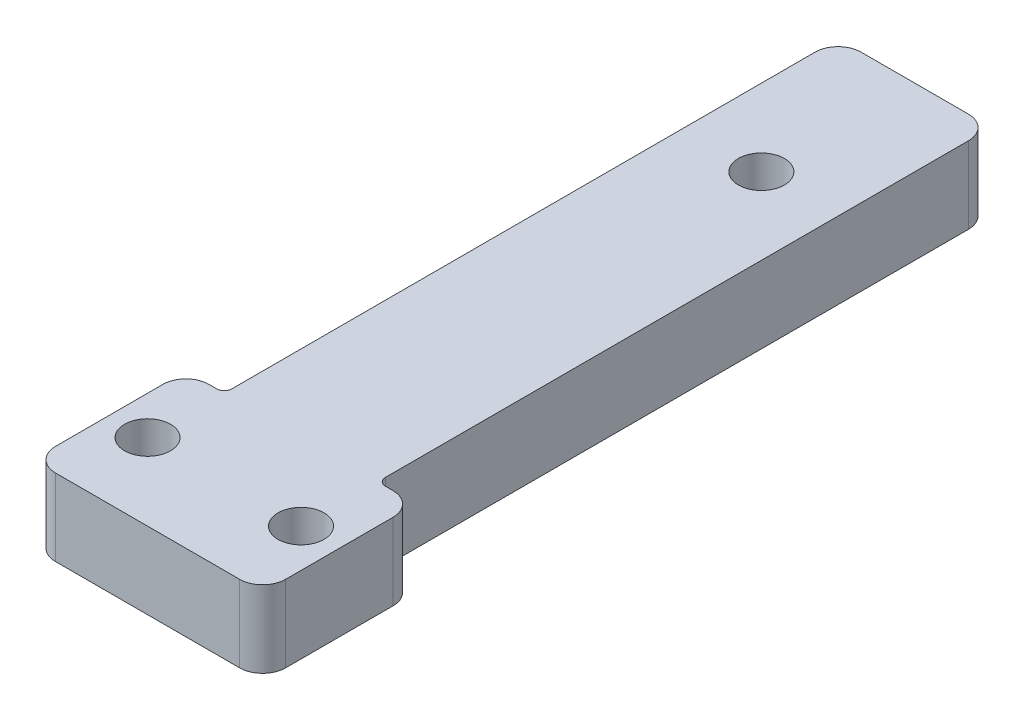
ISO-10303-21;
HEADER;
FILE_DESCRIPTION(('STEP AP214'),'2;1');
FILE_NAME('part.step','',(''),(''),'','','');
FILE_SCHEMA(('AUTOMOTIVE_DESIGN { 1 0 10303 214 1 1 1 1 }'));
ENDSEC;
DATA;
#1=APPLICATION_CONTEXT('core data for automotive mechanical design processes');
#2=APPLICATION_PROTOCOL_DEFINITION('international standard','automotive_design',2000,#1);
#3=PRODUCT_CONTEXT('',#1,'mechanical');
#4=PRODUCT('Part','Part','',(#3));
#5=PRODUCT_RELATED_PRODUCT_CATEGORY('part','',(#4));
#6=PRODUCT_DEFINITION_FORMATION('','',#4);
#7=PRODUCT_DEFINITION_CONTEXT('part definition',#1,'design');
#8=PRODUCT_DEFINITION('design','',#6,#7);
#9=PRODUCT_DEFINITION_SHAPE('','',#8);
#10=(LENGTH_UNIT() NAMED_UNIT(*) SI_UNIT(.MILLI.,.METRE.));
#11=(NAMED_UNIT(*) PLANE_ANGLE_UNIT() SI_UNIT($,.RADIAN.));
#12=(NAMED_UNIT(*) SI_UNIT($,.STERADIAN.) SOLID_ANGLE_UNIT());
#13=UNCERTAINTY_MEASURE_WITH_UNIT(LENGTH_MEASURE(1.E-05),#10,'distance_accuracy_value','');
#14=(GEOMETRIC_REPRESENTATION_CONTEXT(3) GLOBAL_UNCERTAINTY_ASSIGNED_CONTEXT((#13)) GLOBAL_UNIT_ASSIGNED_CONTEXT((#10,
#11,#12)) REPRESENTATION_CONTEXT('',''));
#15=CARTESIAN_POINT('',(0.,0.,0.));
#16=DIRECTION('',(0.,0.,1.));
#17=DIRECTION('',(1.,0.,0.));
#18=AXIS2_PLACEMENT_3D('',#15,#16,#17);
#19=CARTESIAN_POINT('',(22.,10.,-97.));
#20=DIRECTION('',(0.,-1.,0.));
#21=DIRECTION('',(0.,0.,-1.));
#22=AXIS2_PLACEMENT_3D('',#19,#20,#21);
#23=CYLINDRICAL_SURFACE('',#22,3.);
#24=CARTESIAN_POINT('',(22.,0.,-97.));
#25=DIRECTION('',(0.,1.,0.));
#26=DIRECTION('',(0.,0.,1.));
#27=AXIS2_PLACEMENT_3D('',#24,#25,#26);
#28=CIRCLE('',#27,3.);
#29=CARTESIAN_POINT('',(25.,0.,-97.));
#30=VERTEX_POINT('',#29);
#31=CARTESIAN_POINT('',(22.,0.,-100.));
#32=VERTEX_POINT('',#31);
#33=EDGE_CURVE('E177',#30,#32,#28,.T.);
#34=ORIENTED_EDGE('',*,*,#33,.T.);
#35=DIRECTION('',(0.,-1.,0.));
#36=VECTOR('',#35,1.);
#37=CARTESIAN_POINT('',(22.,10.,-100.));
#38=LINE('',#37,#36);
#39=CARTESIAN_POINT('',(22.,10.,-100.));
#40=VERTEX_POINT('',#39);
#41=EDGE_CURVE('E11',#40,#32,#38,.T.);
#42=ORIENTED_EDGE('',*,*,#41,.F.);
#43=CARTESIAN_POINT('',(22.,10.,-97.));
#44=DIRECTION('',(0.,1.,0.));
#45=DIRECTION('',(0.,0.,1.));
#46=AXIS2_PLACEMENT_3D('',#43,#44,#45);
#47=CIRCLE('',#46,3.);
#48=CARTESIAN_POINT('',(25.,10.,-97.));
#49=VERTEX_POINT('',#48);
#50=EDGE_CURVE('E208',#49,#40,#47,.T.);
#51=ORIENTED_EDGE('',*,*,#50,.F.);
#52=DIRECTION('',(0.,-1.,0.));
#53=VECTOR('',#52,1.);
#54=CARTESIAN_POINT('',(25.,10.,-97.));
#55=LINE('',#54,#53);
#56=EDGE_CURVE('E173',#49,#30,#55,.T.);
#57=ORIENTED_EDGE('',*,*,#56,.T.);
#58=EDGE_LOOP('',(#34,#42,#51,#57));
#59=FACE_BOUND('',#58,.T.);
#60=ADVANCED_FACE('F33',(#59),#23,.T.);
#61=CARTESIAN_POINT('',(8.00000000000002,10.,-100.));
#62=DIRECTION('',(0.,0.,1.));
#63=DIRECTION('',(1.,0.,0.));
#64=AXIS2_PLACEMENT_3D('',#61,#62,#63);
#65=PLANE('',#64);
#66=DIRECTION('',(-1.,0.,0.));
#67=VECTOR('',#66,1.);
#68=CARTESIAN_POINT('',(8.00000000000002,0.,-100.));
#69=LINE('',#68,#67);
#70=CARTESIAN_POINT('',(8.,0.,-100.));
#71=VERTEX_POINT('',#70);
#72=EDGE_CURVE('E180',#32,#71,#69,.T.);
#73=ORIENTED_EDGE('',*,*,#72,.T.);
#74=DIRECTION('',(0.,-1.,0.));
#75=VECTOR('',#74,1.);
#76=CARTESIAN_POINT('',(8.,10.,-100.));
#77=LINE('',#76,#75);
#78=CARTESIAN_POINT('',(8.,10.,-100.));
#79=VERTEX_POINT('',#78);
#80=EDGE_CURVE('E41',#79,#71,#77,.T.);
#81=ORIENTED_EDGE('',*,*,#80,.F.);
#82=DIRECTION('',(-1.,0.,0.));
#83=VECTOR('',#82,1.);
#84=CARTESIAN_POINT('',(8.00000000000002,10.,-100.));
#85=LINE('',#84,#83);
#86=EDGE_CURVE('E116',#40,#79,#85,.T.);
#87=ORIENTED_EDGE('',*,*,#86,.F.);
#88=ORIENTED_EDGE('',*,*,#41,.T.);
#89=EDGE_LOOP('',(#73,#81,#87,#88));
#90=FACE_BOUND('',#89,.T.);
#91=ADVANCED_FACE('F308',(#90),#65,.F.);
#92=CARTESIAN_POINT('',(8.,10.,-97.));
#93=DIRECTION('',(0.,-1.,0.));
#94=DIRECTION('',(0.,0.,-1.));
#95=AXIS2_PLACEMENT_3D('',#92,#93,#94);
#96=CYLINDRICAL_SURFACE('',#95,3.);
#97=CARTESIAN_POINT('',(8.,0.,-97.));
#98=DIRECTION('',(0.,1.,0.));
#99=DIRECTION('',(0.,0.,-1.));
#100=AXIS2_PLACEMENT_3D('',#97,#98,#99);
#101=CIRCLE('',#100,3.);
#102=CARTESIAN_POINT('',(5.,0.,-97.));
#103=VERTEX_POINT('',#102);
#104=EDGE_CURVE('E183',#71,#103,#101,.T.);
#105=ORIENTED_EDGE('',*,*,#104,.T.);
#106=DIRECTION('',(0.,-1.,0.));
#107=VECTOR('',#106,1.);
#108=CARTESIAN_POINT('',(5.,10.,-97.));
#109=LINE('',#108,#107);
#110=CARTESIAN_POINT('',(5.,10.,-97.));
#111=VERTEX_POINT('',#110);
#112=EDGE_CURVE('E239',#111,#103,#109,.T.);
#113=ORIENTED_EDGE('',*,*,#112,.F.);
#114=CARTESIAN_POINT('',(8.,10.,-97.));
#115=DIRECTION('',(0.,1.,0.));
#116=DIRECTION('',(0.,0.,-1.));
#117=AXIS2_PLACEMENT_3D('',#114,#115,#116);
#118=CIRCLE('',#117,3.);
#119=EDGE_CURVE('E247',#79,#111,#118,.T.);
#120=ORIENTED_EDGE('',*,*,#119,.F.);
#121=ORIENTED_EDGE('',*,*,#80,.T.);
#122=EDGE_LOOP('',(#105,#113,#120,#121));
#123=FACE_BOUND('',#122,.T.);
#124=ADVANCED_FACE('F245',(#123),#96,.T.);
#125=CARTESIAN_POINT('',(5.,10.,-21.));
#126=DIRECTION('',(1.,0.,0.));
#127=DIRECTION('',(0.,0.,-1.));
#128=AXIS2_PLACEMENT_3D('',#125,#126,#127);
#129=PLANE('',#128);
#130=DIRECTION('',(0.,0.,1.));
#131=VECTOR('',#130,1.);
#132=CARTESIAN_POINT('',(5.,0.,-21.));
#133=LINE('',#132,#131);
#134=CARTESIAN_POINT('',(5.,0.,-21.));
#135=VERTEX_POINT('',#134);
#136=EDGE_CURVE('E185',#103,#135,#133,.T.);
#137=ORIENTED_EDGE('',*,*,#136,.T.);
#138=DIRECTION('',(0.,-1.,0.));
#139=VECTOR('',#138,1.);
#140=CARTESIAN_POINT('',(5.,10.,-21.));
#141=LINE('',#140,#139);
#142=CARTESIAN_POINT('',(5.,10.,-21.));
#143=VERTEX_POINT('',#142);
#144=EDGE_CURVE('E236',#143,#135,#141,.T.);
#145=ORIENTED_EDGE('',*,*,#144,.F.);
#146=DIRECTION('',(0.,0.,1.));
#147=VECTOR('',#146,1.);
#148=CARTESIAN_POINT('',(5.,10.,-21.));
#149=LINE('',#148,#147);
#150=EDGE_CURVE('E265',#111,#143,#149,.T.);
#151=ORIENTED_EDGE('',*,*,#150,.F.);
#152=ORIENTED_EDGE('',*,*,#112,.T.);
#153=EDGE_LOOP('',(#137,#145,#151,#152));
#154=FACE_BOUND('',#153,.T.);
#155=ADVANCED_FACE('F256',(#154),#129,.F.);
#156=CARTESIAN_POINT('',(4.,10.,-21.));
#157=DIRECTION('',(0.,-1.,0.));
#158=DIRECTION('',(0.,0.,-1.));
#159=AXIS2_PLACEMENT_3D('',#156,#157,#158);
#160=CYLINDRICAL_SURFACE('',#159,1.);
#161=CARTESIAN_POINT('',(4.,0.,-21.));
#162=DIRECTION('',(0.,-1.,0.));
#163=DIRECTION('',(0.,0.,1.));
#164=AXIS2_PLACEMENT_3D('',#161,#162,#163);
#165=CIRCLE('',#164,1.);
#166=CARTESIAN_POINT('',(3.99999999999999,0.,-20.));
#167=VERTEX_POINT('',#166);
#168=EDGE_CURVE('E187',#135,#167,#165,.T.);
#169=ORIENTED_EDGE('',*,*,#168,.T.);
#170=DIRECTION('',(0.,-1.,0.));
#171=VECTOR('',#170,1.);
#172=CARTESIAN_POINT('',(3.99999999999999,10.,-20.));
#173=LINE('',#172,#171);
#174=CARTESIAN_POINT('',(3.99999999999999,10.,-20.));
#175=VERTEX_POINT('',#174);
#176=EDGE_CURVE('E233',#175,#167,#173,.T.);
#177=ORIENTED_EDGE('',*,*,#176,.F.);
#178=CARTESIAN_POINT('',(4.,10.,-21.));
#179=DIRECTION('',(0.,-1.,0.));
#180=DIRECTION('',(0.,0.,1.));
#181=AXIS2_PLACEMENT_3D('',#178,#179,#180);
#182=CIRCLE('',#181,1.);
#183=EDGE_CURVE('E262',#143,#175,#182,.T.);
#184=ORIENTED_EDGE('',*,*,#183,.F.);
#185=ORIENTED_EDGE('',*,*,#144,.T.);
#186=EDGE_LOOP('',(#169,#177,#184,#185));
#187=FACE_BOUND('',#186,.T.);
#188=ADVANCED_FACE('F260',(#187),#160,.F.);
#189=CARTESIAN_POINT('',(3.00000000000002,10.,-20.));
#190=DIRECTION('',(0.,0.,1.));
#191=DIRECTION('',(1.,0.,0.));
#192=AXIS2_PLACEMENT_3D('',#189,#190,#191);
#193=PLANE('',#192);
#194=DIRECTION('',(-1.,0.,0.));
#195=VECTOR('',#194,1.);
#196=CARTESIAN_POINT('',(3.00000000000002,0.,-20.));
#197=LINE('',#196,#195);
#198=CARTESIAN_POINT('',(3.,0.,-20.));
#199=VERTEX_POINT('',#198);
#200=EDGE_CURVE('E189',#167,#199,#197,.T.);
#201=ORIENTED_EDGE('',*,*,#200,.T.);
#202=DIRECTION('',(0.,-1.,0.));
#203=VECTOR('',#202,1.);
#204=CARTESIAN_POINT('',(3.,10.,-20.));
#205=LINE('',#204,#203);
#206=CARTESIAN_POINT('',(3.,10.,-20.));
#207=VERTEX_POINT('',#206);
#208=EDGE_CURVE('E230',#207,#199,#205,.T.);
#209=ORIENTED_EDGE('',*,*,#208,.F.);
#210=DIRECTION('',(-1.,0.,0.));
#211=VECTOR('',#210,1.);
#212=CARTESIAN_POINT('',(3.00000000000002,10.,-20.));
#213=LINE('',#212,#211);
#214=EDGE_CURVE('E264',#175,#207,#213,.T.);
#215=ORIENTED_EDGE('',*,*,#214,.F.);
#216=ORIENTED_EDGE('',*,*,#176,.T.);
#217=EDGE_LOOP('',(#201,#209,#215,#216));
#218=FACE_BOUND('',#217,.T.);
#219=ADVANCED_FACE('F321',(#218),#193,.F.);
#220=CARTESIAN_POINT('',(3.,10.,-17.));
#221=DIRECTION('',(0.,-1.,0.));
#222=DIRECTION('',(0.,0.,-1.));
#223=AXIS2_PLACEMENT_3D('',#220,#221,#222);
#224=CYLINDRICAL_SURFACE('',#223,3.);
#225=CARTESIAN_POINT('',(3.,0.,-17.));
#226=DIRECTION('',(0.,1.,0.));
#227=DIRECTION('',(0.,0.,-1.));
#228=AXIS2_PLACEMENT_3D('',#225,#226,#227);
#229=CIRCLE('',#228,3.);
#230=CARTESIAN_POINT('',(0.,0.,-17.));
#231=VERTEX_POINT('',#230);
#232=EDGE_CURVE('E191',#199,#231,#229,.T.);
#233=ORIENTED_EDGE('',*,*,#232,.T.);
#234=DIRECTION('',(0.,-1.,0.));
#235=VECTOR('',#234,1.);
#236=CARTESIAN_POINT('',(0.,10.,-17.));
#237=LINE('',#236,#235);
#238=CARTESIAN_POINT('',(0.,10.,-17.));
#239=VERTEX_POINT('',#238);
#240=EDGE_CURVE('E227',#239,#231,#237,.T.);
#241=ORIENTED_EDGE('',*,*,#240,.F.);
#242=CARTESIAN_POINT('',(3.,10.,-17.));
#243=DIRECTION('',(0.,1.,0.));
#244=DIRECTION('',(0.,0.,-1.));
#245=AXIS2_PLACEMENT_3D('',#242,#243,#244);
#246=CIRCLE('',#245,3.);
#247=EDGE_CURVE('E267',#207,#239,#246,.T.);
#248=ORIENTED_EDGE('',*,*,#247,.F.);
#249=ORIENTED_EDGE('',*,*,#208,.T.);
#250=EDGE_LOOP('',(#233,#241,#248,#249));
#251=FACE_BOUND('',#250,.T.);
#252=ADVANCED_FACE('F324',(#251),#224,.T.);
#253=CARTESIAN_POINT('',(0.,10.,-3.00000000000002));
#254=DIRECTION('',(1.,0.,0.));
#255=DIRECTION('',(0.,0.,-1.));
#256=AXIS2_PLACEMENT_3D('',#253,#254,#255);
#257=PLANE('',#256);
#258=DIRECTION('',(0.,0.,1.));
#259=VECTOR('',#258,1.);
#260=CARTESIAN_POINT('',(0.,0.,-3.00000000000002));
#261=LINE('',#260,#259);
#262=CARTESIAN_POINT('',(0.,0.,-3.00000000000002));
#263=VERTEX_POINT('',#262);
#264=EDGE_CURVE('E193',#231,#263,#261,.T.);
#265=ORIENTED_EDGE('',*,*,#264,.T.);
#266=DIRECTION('',(0.,-1.,0.));
#267=VECTOR('',#266,1.);
#268=CARTESIAN_POINT('',(0.,10.,-3.00000000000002));
#269=LINE('',#268,#267);
#270=CARTESIAN_POINT('',(0.,10.,-3.00000000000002));
#271=VERTEX_POINT('',#270);
#272=EDGE_CURVE('E224',#271,#263,#269,.T.);
#273=ORIENTED_EDGE('',*,*,#272,.F.);
#274=DIRECTION('',(0.,0.,1.));
#275=VECTOR('',#274,1.);
#276=CARTESIAN_POINT('',(0.,10.,-3.00000000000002));
#277=LINE('',#276,#275);
#278=EDGE_CURVE('E273',#239,#271,#277,.T.);
#279=ORIENTED_EDGE('',*,*,#278,.F.);
#280=ORIENTED_EDGE('',*,*,#240,.T.);
#281=EDGE_LOOP('',(#265,#273,#279,#280));
#282=FACE_BOUND('',#281,.T.);
#283=ADVANCED_FACE('F328',(#282),#257,.F.);
#284=CARTESIAN_POINT('',(3.,10.,-3.));
#285=DIRECTION('',(0.,-1.,0.));
#286=DIRECTION('',(0.,0.,-1.));
#287=AXIS2_PLACEMENT_3D('',#284,#285,#286);
#288=CYLINDRICAL_SURFACE('',#287,3.);
#289=CARTESIAN_POINT('',(3.,0.,-3.));
#290=DIRECTION('',(0.,1.,0.));
#291=DIRECTION('',(0.,0.,-1.));
#292=AXIS2_PLACEMENT_3D('',#289,#290,#291);
#293=CIRCLE('',#292,3.);
#294=CARTESIAN_POINT('',(3.00000000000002,0.,0.));
#295=VERTEX_POINT('',#294);
#296=EDGE_CURVE('E195',#263,#295,#293,.T.);
#297=ORIENTED_EDGE('',*,*,#296,.T.);
#298=DIRECTION('',(0.,-1.,0.));
#299=VECTOR('',#298,1.);
#300=CARTESIAN_POINT('',(3.00000000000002,10.,0.));
#301=LINE('',#300,#299);
#302=CARTESIAN_POINT('',(3.00000000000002,10.,0.));
#303=VERTEX_POINT('',#302);
#304=EDGE_CURVE('E221',#303,#295,#301,.T.);
#305=ORIENTED_EDGE('',*,*,#304,.F.);
#306=CARTESIAN_POINT('',(3.,10.,-3.));
#307=DIRECTION('',(0.,1.,0.));
#308=DIRECTION('',(0.,0.,-1.));
#309=AXIS2_PLACEMENT_3D('',#306,#307,#308);
#310=CIRCLE('',#309,3.);
#311=EDGE_CURVE('E275',#271,#303,#310,.T.);
#312=ORIENTED_EDGE('',*,*,#311,.F.);
#313=ORIENTED_EDGE('',*,*,#272,.T.);
#314=EDGE_LOOP('',(#297,#305,#312,#313));
#315=FACE_BOUND('',#314,.T.);
#316=ADVANCED_FACE('F332',(#315),#288,.T.);
#317=CARTESIAN_POINT('',(27.,10.,0.));
#318=DIRECTION('',(0.,0.,-1.));
#319=DIRECTION('',(-1.,0.,0.));
#320=AXIS2_PLACEMENT_3D('',#317,#318,#319);
#321=PLANE('',#320);
#322=DIRECTION('',(1.,0.,0.));
#323=VECTOR('',#322,1.);
#324=CARTESIAN_POINT('',(27.,0.,0.));
#325=LINE('',#324,#323);
#326=CARTESIAN_POINT('',(27.,0.,0.));
#327=VERTEX_POINT('',#326);
#328=EDGE_CURVE('E197',#295,#327,#325,.T.);
#329=ORIENTED_EDGE('',*,*,#328,.T.);
#330=DIRECTION('',(0.,-1.,0.));
#331=VECTOR('',#330,1.);
#332=CARTESIAN_POINT('',(27.,10.,0.));
#333=LINE('',#332,#331);
#334=CARTESIAN_POINT('',(27.,10.,0.));
#335=VERTEX_POINT('',#334);
#336=EDGE_CURVE('E218',#335,#327,#333,.T.);
#337=ORIENTED_EDGE('',*,*,#336,.F.);
#338=DIRECTION('',(1.,0.,0.));
#339=VECTOR('',#338,1.);
#340=CARTESIAN_POINT('',(27.,10.,0.));
#341=LINE('',#340,#339);
#342=EDGE_CURVE('E277',#303,#335,#341,.T.);
#343=ORIENTED_EDGE('',*,*,#342,.F.);
#344=ORIENTED_EDGE('',*,*,#304,.T.);
#345=EDGE_LOOP('',(#329,#337,#343,#344));
#346=FACE_BOUND('',#345,.T.);
#347=ADVANCED_FACE('F336',(#346),#321,.F.);
#348=CARTESIAN_POINT('',(27.,10.,-3.));
#349=DIRECTION('',(0.,-1.,0.));
#350=DIRECTION('',(0.,0.,-1.));
#351=AXIS2_PLACEMENT_3D('',#348,#349,#350);
#352=CYLINDRICAL_SURFACE('',#351,3.);
#353=CARTESIAN_POINT('',(27.,0.,-3.));
#354=DIRECTION('',(0.,1.,0.));
#355=DIRECTION('',(0.,0.,1.));
#356=AXIS2_PLACEMENT_3D('',#353,#354,#355);
#357=CIRCLE('',#356,3.);
#358=CARTESIAN_POINT('',(30.,0.,-3.00000000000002));
#359=VERTEX_POINT('',#358);
#360=EDGE_CURVE('E199',#327,#359,#357,.T.);
#361=ORIENTED_EDGE('',*,*,#360,.T.);
#362=DIRECTION('',(0.,-1.,0.));
#363=VECTOR('',#362,1.);
#364=CARTESIAN_POINT('',(30.,10.,-3.00000000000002));
#365=LINE('',#364,#363);
#366=CARTESIAN_POINT('',(30.,10.,-3.00000000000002));
#367=VERTEX_POINT('',#366);
#368=EDGE_CURVE('E215',#367,#359,#365,.T.);
#369=ORIENTED_EDGE('',*,*,#368,.F.);
#370=CARTESIAN_POINT('',(27.,10.,-3.));
#371=DIRECTION('',(0.,1.,0.));
#372=DIRECTION('',(0.,0.,1.));
#373=AXIS2_PLACEMENT_3D('',#370,#371,#372);
#374=CIRCLE('',#373,3.);
#375=EDGE_CURVE('E279',#335,#367,#374,.T.);
#376=ORIENTED_EDGE('',*,*,#375,.F.);
#377=ORIENTED_EDGE('',*,*,#336,.T.);
#378=EDGE_LOOP('',(#361,#369,#376,#377));
#379=FACE_BOUND('',#378,.T.);
#380=ADVANCED_FACE('F340',(#379),#352,.T.);
#381=CARTESIAN_POINT('',(30.,10.,-17.));
#382=DIRECTION('',(-1.,0.,0.));
#383=DIRECTION('',(0.,0.,1.));
#384=AXIS2_PLACEMENT_3D('',#381,#382,#383);
#385=PLANE('',#384);
#386=DIRECTION('',(0.,0.,-1.));
#387=VECTOR('',#386,1.);
#388=CARTESIAN_POINT('',(30.,0.,-17.));
#389=LINE('',#388,#387);
#390=CARTESIAN_POINT('',(30.,0.,-17.));
#391=VERTEX_POINT('',#390);
#392=EDGE_CURVE('E201',#359,#391,#389,.T.);
#393=ORIENTED_EDGE('',*,*,#392,.T.);
#394=DIRECTION('',(0.,-1.,0.));
#395=VECTOR('',#394,1.);
#396=CARTESIAN_POINT('',(30.,10.,-17.));
#397=LINE('',#396,#395);
#398=CARTESIAN_POINT('',(30.,10.,-17.));
#399=VERTEX_POINT('',#398);
#400=EDGE_CURVE('E212',#399,#391,#397,.T.);
#401=ORIENTED_EDGE('',*,*,#400,.F.);
#402=DIRECTION('',(0.,0.,-1.));
#403=VECTOR('',#402,1.);
#404=CARTESIAN_POINT('',(30.,10.,-17.));
#405=LINE('',#404,#403);
#406=EDGE_CURVE('E281',#367,#399,#405,.T.);
#407=ORIENTED_EDGE('',*,*,#406,.F.);
#408=ORIENTED_EDGE('',*,*,#368,.T.);
#409=EDGE_LOOP('',(#393,#401,#407,#408));
#410=FACE_BOUND('',#409,.T.);
#411=ADVANCED_FACE('F287',(#410),#385,.F.);
#412=CARTESIAN_POINT('',(27.,10.,-17.));
#413=DIRECTION('',(0.,-1.,0.));
#414=DIRECTION('',(0.,0.,-1.));
#415=AXIS2_PLACEMENT_3D('',#412,#413,#414);
#416=CYLINDRICAL_SURFACE('',#415,3.);
#417=CARTESIAN_POINT('',(27.,0.,-17.));
#418=DIRECTION('',(0.,1.,0.));
#419=DIRECTION('',(0.,0.,1.));
#420=AXIS2_PLACEMENT_3D('',#417,#418,#419);
#421=CIRCLE('',#420,3.);
#422=CARTESIAN_POINT('',(27.,0.,-20.));
#423=VERTEX_POINT('',#422);
#424=EDGE_CURVE('E203',#391,#423,#421,.T.);
#425=ORIENTED_EDGE('',*,*,#424,.T.);
#426=DIRECTION('',(0.,-1.,0.));
#427=VECTOR('',#426,1.);
#428=CARTESIAN_POINT('',(27.,10.,-20.));
#429=LINE('',#428,#427);
#430=CARTESIAN_POINT('',(27.,10.,-20.));
#431=VERTEX_POINT('',#430);
#432=EDGE_CURVE('E168',#431,#423,#429,.T.);
#433=ORIENTED_EDGE('',*,*,#432,.F.);
#434=CARTESIAN_POINT('',(27.,10.,-17.));
#435=DIRECTION('',(0.,1.,0.));
#436=DIRECTION('',(0.,0.,1.));
#437=AXIS2_PLACEMENT_3D('',#434,#435,#436);
#438=CIRCLE('',#437,3.);
#439=EDGE_CURVE('E159',#399,#431,#438,.T.);
#440=ORIENTED_EDGE('',*,*,#439,.F.);
#441=ORIENTED_EDGE('',*,*,#400,.T.);
#442=EDGE_LOOP('',(#425,#433,#440,#441));
#443=FACE_BOUND('',#442,.T.);
#444=ADVANCED_FACE('F291',(#443),#416,.T.);
#445=CARTESIAN_POINT('',(26.,10.,-20.));
#446=DIRECTION('',(0.,0.,1.));
#447=DIRECTION('',(1.,0.,0.));
#448=AXIS2_PLACEMENT_3D('',#445,#446,#447);
#449=PLANE('',#448);
#450=DIRECTION('',(-1.,0.,0.));
#451=VECTOR('',#450,1.);
#452=CARTESIAN_POINT('',(26.,0.,-20.));
#453=LINE('',#452,#451);
#454=CARTESIAN_POINT('',(26.,0.,-20.));
#455=VERTEX_POINT('',#454);
#456=EDGE_CURVE('E167',#423,#455,#453,.T.);
#457=ORIENTED_EDGE('',*,*,#456,.T.);
#458=DIRECTION('',(0.,-1.,0.));
#459=VECTOR('',#458,1.);
#460=CARTESIAN_POINT('',(26.,10.,-20.));
#461=LINE('',#460,#459);
#462=CARTESIAN_POINT('',(26.,10.,-20.));
#463=VERTEX_POINT('',#462);
#464=EDGE_CURVE('E164',#463,#455,#461,.T.);
#465=ORIENTED_EDGE('',*,*,#464,.F.);
#466=DIRECTION('',(-1.,0.,0.));
#467=VECTOR('',#466,1.);
#468=CARTESIAN_POINT('',(26.,10.,-20.));
#469=LINE('',#468,#467);
#470=EDGE_CURVE('E153',#431,#463,#469,.T.);
#471=ORIENTED_EDGE('',*,*,#470,.F.);
#472=ORIENTED_EDGE('',*,*,#432,.T.);
#473=EDGE_LOOP('',(#457,#465,#471,#472));
#474=FACE_BOUND('',#473,.T.);
#475=ADVANCED_FACE('F165',(#474),#449,.F.);
#476=CARTESIAN_POINT('',(26.,10.,-21.));
#477=DIRECTION('',(0.,-1.,0.));
#478=DIRECTION('',(0.,0.,-1.));
#479=AXIS2_PLACEMENT_3D('',#476,#477,#478);
#480=CYLINDRICAL_SURFACE('',#479,1.);
#481=CARTESIAN_POINT('',(26.,0.,-21.));
#482=DIRECTION('',(0.,-1.,0.));
#483=DIRECTION('',(0.,0.,-1.));
#484=AXIS2_PLACEMENT_3D('',#481,#482,#483);
#485=CIRCLE('',#484,1.);
#486=CARTESIAN_POINT('',(25.,0.,-21.));
#487=VERTEX_POINT('',#486);
#488=EDGE_CURVE('E102',#455,#487,#485,.T.);
#489=ORIENTED_EDGE('',*,*,#488,.T.);
#490=DIRECTION('',(0.,-1.,0.));
#491=VECTOR('',#490,1.);
#492=CARTESIAN_POINT('',(25.,10.,-21.));
#493=LINE('',#492,#491);
#494=CARTESIAN_POINT('',(25.,10.,-21.));
#495=VERTEX_POINT('',#494);
#496=EDGE_CURVE('E169',#495,#487,#493,.T.);
#497=ORIENTED_EDGE('',*,*,#496,.F.);
#498=CARTESIAN_POINT('',(26.,10.,-21.));
#499=DIRECTION('',(0.,-1.,0.));
#500=DIRECTION('',(0.,0.,-1.));
#501=AXIS2_PLACEMENT_3D('',#498,#499,#500);
#502=CIRCLE('',#501,1.);
#503=EDGE_CURVE('E157',#463,#495,#502,.T.);
#504=ORIENTED_EDGE('',*,*,#503,.F.);
#505=ORIENTED_EDGE('',*,*,#464,.T.);
#506=EDGE_LOOP('',(#489,#497,#504,#505));
#507=FACE_BOUND('',#506,.T.);
#508=ADVANCED_FACE('F171',(#507),#480,.F.);
#509=CARTESIAN_POINT('',(25.,10.,-97.));
#510=DIRECTION('',(-1.,0.,0.));
#511=DIRECTION('',(0.,0.,1.));
#512=AXIS2_PLACEMENT_3D('',#509,#510,#511);
#513=PLANE('',#512);
#514=DIRECTION('',(0.,0.,-1.));
#515=VECTOR('',#514,1.);
#516=CARTESIAN_POINT('',(25.,0.,-97.));
#517=LINE('',#516,#515);
#518=EDGE_CURVE('E108',#487,#30,#517,.T.);
#519=ORIENTED_EDGE('',*,*,#518,.T.);
#520=ORIENTED_EDGE('',*,*,#56,.F.);
#521=DIRECTION('',(0.,0.,-1.));
#522=VECTOR('',#521,1.);
#523=CARTESIAN_POINT('',(25.,10.,-97.));
#524=LINE('',#523,#522);
#525=EDGE_CURVE('E49',#495,#49,#524,.T.);
#526=ORIENTED_EDGE('',*,*,#525,.F.);
#527=ORIENTED_EDGE('',*,*,#496,.T.);
#528=EDGE_LOOP('',(#519,#520,#526,#527));
#529=FACE_BOUND('',#528,.T.);
#530=ADVANCED_FACE('F295',(#529),#513,.F.);
#531=CARTESIAN_POINT('',(22.,10.,-97.));
#532=DIRECTION('',(0.,1.,0.));
#533=DIRECTION('',(0.,0.,1.));
#534=AXIS2_PLACEMENT_3D('',#531,#532,#533);
#535=PLANE('',#534);
#536=CARTESIAN_POINT('',(25.,10.,-10.));
#537=DIRECTION('',(0.,1.,0.));
#538=DIRECTION('',(0.,0.,1.));
#539=AXIS2_PLACEMENT_3D('',#536,#537,#538);
#540=CIRCLE('',#539,2.99999999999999);
#541=CARTESIAN_POINT('',(25.,10.,-7.00000000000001));
#542=VERTEX_POINT('',#541);
#543=EDGE_CURVE('E411',#542,#542,#540,.T.);
#544=ORIENTED_EDGE('',*,*,#543,.F.);
#545=EDGE_LOOP('',(#544));
#546=FACE_BOUND('',#545,.T.);
#547=CARTESIAN_POINT('',(15.,10.,-80.));
#548=DIRECTION('',(0.,1.,0.));
#549=DIRECTION('',(0.,0.,1.));
#550=AXIS2_PLACEMENT_3D('',#547,#548,#549);
#551=CIRCLE('',#550,3.);
#552=CARTESIAN_POINT('',(15.,10.,-77.));
#553=VERTEX_POINT('',#552);
#554=EDGE_CURVE('E417',#553,#553,#551,.T.);
#555=ORIENTED_EDGE('',*,*,#554,.F.);
#556=EDGE_LOOP('',(#555));
#557=FACE_BOUND('',#556,.T.);
#558=CARTESIAN_POINT('',(5.,10.,-10.));
#559=DIRECTION('',(0.,1.,0.));
#560=DIRECTION('',(0.,0.,1.));
#561=AXIS2_PLACEMENT_3D('',#558,#559,#560);
#562=CIRCLE('',#561,3.);
#563=CARTESIAN_POINT('',(5.,10.,-7.));
#564=VERTEX_POINT('',#563);
#565=EDGE_CURVE('E414',#564,#564,#562,.T.);
#566=ORIENTED_EDGE('',*,*,#565,.F.);
#567=EDGE_LOOP('',(#566));
#568=FACE_BOUND('',#567,.T.);
#569=ORIENTED_EDGE('',*,*,#50,.T.);
#570=ORIENTED_EDGE('',*,*,#86,.T.);
#571=ORIENTED_EDGE('',*,*,#119,.T.);
#572=ORIENTED_EDGE('',*,*,#150,.T.);
#573=ORIENTED_EDGE('',*,*,#183,.T.);
#574=ORIENTED_EDGE('',*,*,#214,.T.);
#575=ORIENTED_EDGE('',*,*,#247,.T.);
#576=ORIENTED_EDGE('',*,*,#278,.T.);
#577=ORIENTED_EDGE('',*,*,#311,.T.);
#578=ORIENTED_EDGE('',*,*,#342,.T.);
#579=ORIENTED_EDGE('',*,*,#375,.T.);
#580=ORIENTED_EDGE('',*,*,#406,.T.);
#581=ORIENTED_EDGE('',*,*,#439,.T.);
#582=ORIENTED_EDGE('',*,*,#470,.T.);
#583=ORIENTED_EDGE('',*,*,#503,.T.);
#584=ORIENTED_EDGE('',*,*,#525,.T.);
#585=EDGE_LOOP('',(#569,#570,#571,#572,#573,#574,#575,#576,#577,#578,#579,#580,#581,#582,#583,#584));
#586=FACE_BOUND('',#585,.T.);
#587=ADVANCED_FACE('F155',(#546,#557,#568,#586),#535,.T.);
#588=CARTESIAN_POINT('',(22.,0.,-97.));
#589=DIRECTION('',(0.,1.,0.));
#590=DIRECTION('',(0.,0.,1.));
#591=AXIS2_PLACEMENT_3D('',#588,#589,#590);
#592=PLANE('',#591);
#593=CARTESIAN_POINT('',(25.,0.,-10.));
#594=DIRECTION('',(0.,1.,0.));
#595=DIRECTION('',(0.,0.,1.));
#596=AXIS2_PLACEMENT_3D('',#593,#594,#595);
#597=CIRCLE('',#596,2.99999999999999);
#598=CARTESIAN_POINT('',(25.,0.,-7.00000000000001));
#599=VERTEX_POINT('',#598);
#600=EDGE_CURVE('E408',#599,#599,#597,.T.);
#601=ORIENTED_EDGE('',*,*,#600,.T.);
#602=EDGE_LOOP('',(#601));
#603=FACE_BOUND('',#602,.T.);
#604=CARTESIAN_POINT('',(15.,0.,-80.));
#605=DIRECTION('',(0.,1.,0.));
#606=DIRECTION('',(0.,0.,1.));
#607=AXIS2_PLACEMENT_3D('',#604,#605,#606);
#608=CIRCLE('',#607,3.);
#609=CARTESIAN_POINT('',(15.,0.,-77.));
#610=VERTEX_POINT('',#609);
#611=EDGE_CURVE('E412',#610,#610,#608,.T.);
#612=ORIENTED_EDGE('',*,*,#611,.T.);
#613=EDGE_LOOP('',(#612));
#614=FACE_BOUND('',#613,.T.);
#615=CARTESIAN_POINT('',(5.,0.,-10.));
#616=DIRECTION('',(0.,1.,0.));
#617=DIRECTION('',(0.,0.,1.));
#618=AXIS2_PLACEMENT_3D('',#615,#616,#617);
#619=CIRCLE('',#618,3.);
#620=CARTESIAN_POINT('',(5.,0.,-7.));
#621=VERTEX_POINT('',#620);
#622=EDGE_CURVE('E181',#621,#621,#619,.T.);
#623=ORIENTED_EDGE('',*,*,#622,.T.);
#624=EDGE_LOOP('',(#623));
#625=FACE_BOUND('',#624,.T.);
#626=ORIENTED_EDGE('',*,*,#33,.F.);
#627=ORIENTED_EDGE('',*,*,#518,.F.);
#628=ORIENTED_EDGE('',*,*,#488,.F.);
#629=ORIENTED_EDGE('',*,*,#456,.F.);
#630=ORIENTED_EDGE('',*,*,#424,.F.);
#631=ORIENTED_EDGE('',*,*,#392,.F.);
#632=ORIENTED_EDGE('',*,*,#360,.F.);
#633=ORIENTED_EDGE('',*,*,#328,.F.);
#634=ORIENTED_EDGE('',*,*,#296,.F.);
#635=ORIENTED_EDGE('',*,*,#264,.F.);
#636=ORIENTED_EDGE('',*,*,#232,.F.);
#637=ORIENTED_EDGE('',*,*,#200,.F.);
#638=ORIENTED_EDGE('',*,*,#168,.F.);
#639=ORIENTED_EDGE('',*,*,#136,.F.);
#640=ORIENTED_EDGE('',*,*,#104,.F.);
#641=ORIENTED_EDGE('',*,*,#72,.F.);
#642=EDGE_LOOP('',(#626,#627,#628,#629,#630,#631,#632,#633,#634,#635,#636,#637,#638,#639,#640,#641));
#643=FACE_BOUND('',#642,.T.);
#644=ADVANCED_FACE('F251',(#603,#614,#625,#643),#592,.F.);
#645=CARTESIAN_POINT('',(5.,0.,-10.));
#646=DIRECTION('',(0.,1.,0.));
#647=DIRECTION('',(0.,0.,1.));
#648=AXIS2_PLACEMENT_3D('',#645,#646,#647);
#649=CYLINDRICAL_SURFACE('',#648,3.);
#650=ORIENTED_EDGE('',*,*,#622,.F.);
#651=EDGE_LOOP('',(#650));
#652=FACE_BOUND('',#651,.T.);
#653=ORIENTED_EDGE('',*,*,#565,.T.);
#654=EDGE_LOOP('',(#653));
#655=FACE_BOUND('',#654,.T.);
#656=ADVANCED_FACE('F373',(#652,#655),#649,.F.);
#657=CARTESIAN_POINT('',(15.,0.,-80.));
#658=DIRECTION('',(0.,1.,0.));
#659=DIRECTION('',(0.,0.,1.));
#660=AXIS2_PLACEMENT_3D('',#657,#658,#659);
#661=CYLINDRICAL_SURFACE('',#660,3.);
#662=ORIENTED_EDGE('',*,*,#611,.F.);
#663=EDGE_LOOP('',(#662));
#664=FACE_BOUND('',#663,.T.);
#665=ORIENTED_EDGE('',*,*,#554,.T.);
#666=EDGE_LOOP('',(#665));
#667=FACE_BOUND('',#666,.T.);
#668=ADVANCED_FACE('F381',(#664,#667),#661,.F.);
#669=CARTESIAN_POINT('',(25.,0.,-10.));
#670=DIRECTION('',(0.,1.,0.));
#671=DIRECTION('',(0.,0.,1.));
#672=AXIS2_PLACEMENT_3D('',#669,#670,#671);
#673=CYLINDRICAL_SURFACE('',#672,2.99999999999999);
#674=ORIENTED_EDGE('',*,*,#600,.F.);
#675=EDGE_LOOP('',(#674));
#676=FACE_BOUND('',#675,.T.);
#677=ORIENTED_EDGE('',*,*,#543,.T.);
#678=EDGE_LOOP('',(#677));
#679=FACE_BOUND('',#678,.T.);
#680=ADVANCED_FACE('F391',(#676,#679),#673,.F.);
#681=CLOSED_SHELL('',(#60,#91,#124,#155,#188,#219,#252,#283,#316,#347,#380,#411,#444,#475,#508,
#530,#587,#644,#656,#668,#680));
#682=MANIFOLD_SOLID_BREP('B2',#681);
#683=ADVANCED_BREP_SHAPE_REPRESENTATION('',(#18,#682),#14);
#684=SHAPE_DEFINITION_REPRESENTATION(#9,#683);
ENDSEC;
END-ISO-10303-21;
